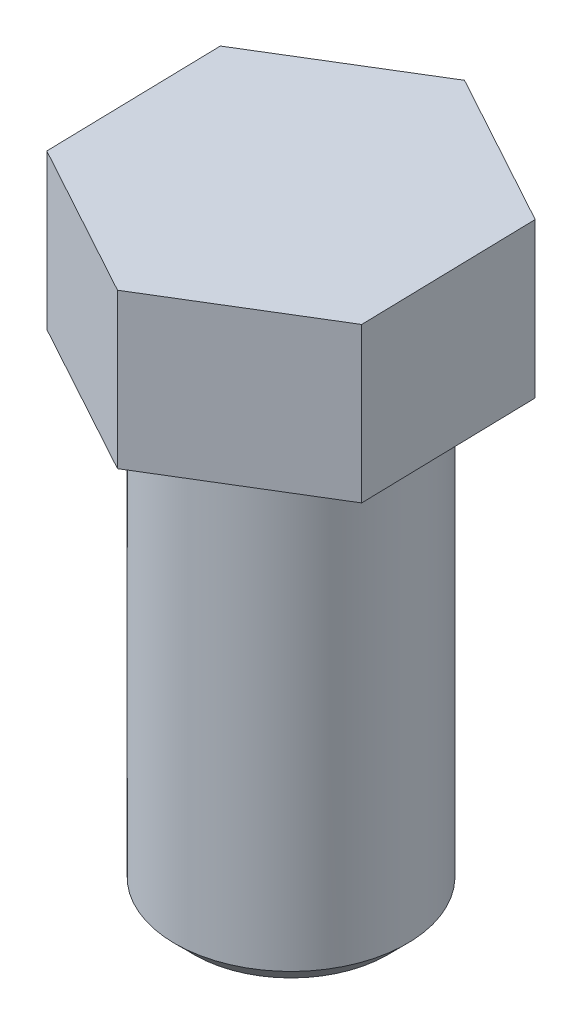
ISO-10303-21;
HEADER;
FILE_DESCRIPTION(('STEP AP214'),'2;1');
FILE_NAME('part.step','',(''),(''),'','','');
FILE_SCHEMA(('AUTOMOTIVE_DESIGN { 1 0 10303 214 1 1 1 1 }'));
ENDSEC;
DATA;
#1=APPLICATION_CONTEXT('core data for automotive mechanical design processes');
#2=APPLICATION_PROTOCOL_DEFINITION('international standard','automotive_design',2000,#1);
#3=PRODUCT_CONTEXT('',#1,'mechanical');
#4=PRODUCT('Part','Part','',(#3));
#5=PRODUCT_RELATED_PRODUCT_CATEGORY('part','',(#4));
#6=PRODUCT_DEFINITION_FORMATION('','',#4);
#7=PRODUCT_DEFINITION_CONTEXT('part definition',#1,'design');
#8=PRODUCT_DEFINITION('design','',#6,#7);
#9=PRODUCT_DEFINITION_SHAPE('','',#8);
#10=(LENGTH_UNIT() NAMED_UNIT(*) SI_UNIT(.MILLI.,.METRE.));
#11=(NAMED_UNIT(*) PLANE_ANGLE_UNIT() SI_UNIT($,.RADIAN.));
#12=(NAMED_UNIT(*) SI_UNIT($,.STERADIAN.) SOLID_ANGLE_UNIT());
#13=UNCERTAINTY_MEASURE_WITH_UNIT(LENGTH_MEASURE(1.E-05),#10,'distance_accuracy_value','');
#14=(GEOMETRIC_REPRESENTATION_CONTEXT(3) GLOBAL_UNCERTAINTY_ASSIGNED_CONTEXT((#13)) GLOBAL_UNIT_ASSIGNED_CONTEXT((#10,
#11,#12)) REPRESENTATION_CONTEXT('',''));
#15=CARTESIAN_POINT('',(0.,0.,0.));
#16=DIRECTION('',(0.,0.,1.));
#17=DIRECTION('',(1.,0.,0.));
#18=AXIS2_PLACEMENT_3D('',#15,#16,#17);
#19=CARTESIAN_POINT('',(0.,50.,0.));
#20=DIRECTION('',(0.,1.,0.));
#21=DIRECTION('',(0.,0.,1.));
#22=AXIS2_PLACEMENT_3D('',#19,#20,#21);
#23=CYLINDRICAL_SURFACE('',#22,3.);
#24=CARTESIAN_POINT('',(0.,0.500000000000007,0.));
#25=DIRECTION('',(0.,-1.,0.));
#26=DIRECTION('',(0.,0.,-1.));
#27=AXIS2_PLACEMENT_3D('',#24,#25,#26);
#28=CIRCLE('',#27,3.);
#29=CARTESIAN_POINT('',(0.,0.500000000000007,-3.));
#30=VERTEX_POINT('',#29);
#31=EDGE_CURVE('E38',#30,#30,#28,.F.);
#32=ORIENTED_EDGE('',*,*,#31,.T.);
#33=EDGE_LOOP('',(#32));
#34=FACE_BOUND('',#33,.T.);
#35=CARTESIAN_POINT('',(0.,12.,0.));
#36=DIRECTION('',(0.,1.,0.));
#37=DIRECTION('',(0.,0.,1.));
#38=AXIS2_PLACEMENT_3D('',#35,#36,#37);
#39=CIRCLE('',#38,3.);
#40=CARTESIAN_POINT('',(0.,12.,3.));
#41=VERTEX_POINT('',#40);
#42=EDGE_CURVE('E101',#41,#41,#39,.T.);
#43=ORIENTED_EDGE('',*,*,#42,.F.);
#44=EDGE_LOOP('',(#43));
#45=FACE_BOUND('',#44,.T.);
#46=ADVANCED_FACE('F31',(#34,#45),#23,.T.);
#47=CARTESIAN_POINT('',(-3.00000000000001,0.,0.));
#48=DIRECTION('',(0.,-1.,0.));
#49=DIRECTION('',(0.,0.,-1.));
#50=AXIS2_PLACEMENT_3D('',#47,#48,#49);
#51=PLANE('',#50);
#52=CARTESIAN_POINT('',(0.,0.,0.));
#53=DIRECTION('',(0.,-1.,0.));
#54=DIRECTION('',(0.,0.,-1.));
#55=AXIS2_PLACEMENT_3D('',#52,#53,#54);
#56=CIRCLE('',#55,2.5);
#57=CARTESIAN_POINT('',(0.,0.,-2.5));
#58=VERTEX_POINT('',#57);
#59=EDGE_CURVE('E11',#58,#58,#56,.T.);
#60=ORIENTED_EDGE('',*,*,#59,.T.);
#61=EDGE_LOOP('',(#60));
#62=FACE_BOUND('',#61,.T.);
#63=ADVANCED_FACE('F144',(#62),#51,.T.);
#64=CARTESIAN_POINT('',(0.,0.500000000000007,0.));
#65=DIRECTION('',(0.,1.,0.));
#66=DIRECTION('',(0.,0.,1.));
#67=AXIS2_PLACEMENT_3D('',#64,#65,#66);
#68=CONICAL_SURFACE('',#67,3.,0.785398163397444);
#69=ORIENTED_EDGE('',*,*,#59,.F.);
#70=EDGE_LOOP('',(#69));
#71=FACE_BOUND('',#70,.T.);
#72=ORIENTED_EDGE('',*,*,#31,.F.);
#73=EDGE_LOOP('',(#72));
#74=FACE_BOUND('',#73,.T.);
#75=ADVANCED_FACE('F142',(#71,#74),#68,.T.);
#76=CARTESIAN_POINT('',(4.03522053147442,16.,2.20566412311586));
#77=DIRECTION('',(-0.999726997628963,0.,0.0233651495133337));
#78=DIRECTION('',(0.0233651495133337,0.,0.999726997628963));
#79=AXIS2_PLACEMENT_3D('',#76,#77,#78);
#80=PLANE('',#79);
#81=DIRECTION('',(-0.0233651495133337,0.,-0.999726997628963));
#82=VECTOR('',#81,1.);
#83=CARTESIAN_POINT('',(4.03522053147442,12.,2.20566412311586));
#84=LINE('',#83,#82);
#85=CARTESIAN_POINT('',(4.03522053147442,12.,2.20566412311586));
#86=VERTEX_POINT('',#85);
#87=CARTESIAN_POINT('',(3.92777142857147,12.,-2.39177142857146));
#88=VERTEX_POINT('',#87);
#89=EDGE_CURVE('E88',#86,#88,#84,.T.);
#90=ORIENTED_EDGE('',*,*,#89,.T.);
#91=DIRECTION('',(0.,-1.,0.));
#92=VECTOR('',#91,1.);
#93=CARTESIAN_POINT('',(3.92777142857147,16.,-2.39177142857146));
#94=LINE('',#93,#92);
#95=CARTESIAN_POINT('',(3.92777142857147,16.,-2.39177142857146));
#96=VERTEX_POINT('',#95);
#97=EDGE_CURVE('E96',#96,#88,#94,.T.);
#98=ORIENTED_EDGE('',*,*,#97,.F.);
#99=DIRECTION('',(-0.0233651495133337,0.,-0.999726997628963));
#100=VECTOR('',#99,1.);
#101=CARTESIAN_POINT('',(4.03522053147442,16.,2.20566412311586));
#102=LINE('',#101,#100);
#103=CARTESIAN_POINT('',(4.03522053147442,16.,2.20566412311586));
#104=VERTEX_POINT('',#103);
#105=EDGE_CURVE('E116',#104,#96,#102,.T.);
#106=ORIENTED_EDGE('',*,*,#105,.F.);
#107=DIRECTION('',(0.,-1.,0.));
#108=VECTOR('',#107,1.);
#109=CARTESIAN_POINT('',(4.03522053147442,16.,2.20566412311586));
#110=LINE('',#109,#108);
#111=EDGE_CURVE('E106',#104,#86,#110,.T.);
#112=ORIENTED_EDGE('',*,*,#111,.T.);
#113=EDGE_LOOP('',(#90,#98,#106,#112));
#114=FACE_BOUND('',#113,.T.);
#115=ADVANCED_FACE('F105',(#114),#80,.F.);
#116=CARTESIAN_POINT('',(3.92777142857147,16.,-2.39177142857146));
#117=DIRECTION('',(-0.479628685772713,0.,0.877471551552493));
#118=DIRECTION('',(0.877471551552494,0.,0.479628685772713));
#119=AXIS2_PLACEMENT_3D('',#116,#117,#118);
#120=PLANE('',#119);
#121=DIRECTION('',(-0.877471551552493,0.,-0.479628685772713));
#122=VECTOR('',#121,1.);
#123=CARTESIAN_POINT('',(3.92777142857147,12.,-2.39177142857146));
#124=LINE('',#123,#122);
#125=CARTESIAN_POINT('',(-0.107449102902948,12.,-4.59743555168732));
#126=VERTEX_POINT('',#125);
#127=EDGE_CURVE('E83',#88,#126,#124,.T.);
#128=ORIENTED_EDGE('',*,*,#127,.T.);
#129=DIRECTION('',(0.,-1.,0.));
#130=VECTOR('',#129,1.);
#131=CARTESIAN_POINT('',(-0.107449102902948,16.,-4.59743555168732));
#132=LINE('',#131,#130);
#133=CARTESIAN_POINT('',(-0.107449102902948,16.,-4.59743555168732));
#134=VERTEX_POINT('',#133);
#135=EDGE_CURVE('E102',#134,#126,#132,.T.);
#136=ORIENTED_EDGE('',*,*,#135,.F.);
#137=DIRECTION('',(-0.877471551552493,0.,-0.479628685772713));
#138=VECTOR('',#137,1.);
#139=CARTESIAN_POINT('',(3.92777142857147,16.,-2.39177142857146));
#140=LINE('',#139,#138);
#141=EDGE_CURVE('E98',#96,#134,#140,.T.);
#142=ORIENTED_EDGE('',*,*,#141,.F.);
#143=ORIENTED_EDGE('',*,*,#97,.T.);
#144=EDGE_LOOP('',(#128,#136,#142,#143));
#145=FACE_BOUND('',#144,.T.);
#146=ADVANCED_FACE('F97',(#145),#120,.F.);
#147=CARTESIAN_POINT('',(-0.107449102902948,16.,-4.59743555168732));
#148=DIRECTION('',(0.52009831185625,0.,0.85410640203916));
#149=DIRECTION('',(0.85410640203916,0.,-0.52009831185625));
#150=AXIS2_PLACEMENT_3D('',#147,#148,#149);
#151=PLANE('',#150);
#152=DIRECTION('',(-0.85410640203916,0.,0.52009831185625));
#153=VECTOR('',#152,1.);
#154=CARTESIAN_POINT('',(-0.107449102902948,12.,-4.59743555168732));
#155=LINE('',#154,#153);
#156=CARTESIAN_POINT('',(-4.03522053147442,12.,-2.20566412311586));
#157=VERTEX_POINT('',#156);
#158=EDGE_CURVE('E90',#126,#157,#155,.T.);
#159=ORIENTED_EDGE('',*,*,#158,.T.);
#160=DIRECTION('',(0.,-1.,0.));
#161=VECTOR('',#160,1.);
#162=CARTESIAN_POINT('',(-4.03522053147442,16.,-2.20566412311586));
#163=LINE('',#162,#161);
#164=CARTESIAN_POINT('',(-4.03522053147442,16.,-2.20566412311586));
#165=VERTEX_POINT('',#164);
#166=EDGE_CURVE('E132',#165,#157,#163,.T.);
#167=ORIENTED_EDGE('',*,*,#166,.F.);
#168=DIRECTION('',(-0.85410640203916,0.,0.52009831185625));
#169=VECTOR('',#168,1.);
#170=CARTESIAN_POINT('',(-0.107449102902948,16.,-4.59743555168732));
#171=LINE('',#170,#169);
#172=EDGE_CURVE('E119',#134,#165,#171,.T.);
#173=ORIENTED_EDGE('',*,*,#172,.F.);
#174=ORIENTED_EDGE('',*,*,#135,.T.);
#175=EDGE_LOOP('',(#159,#167,#173,#174));
#176=FACE_BOUND('',#175,.T.);
#177=ADVANCED_FACE('F174',(#176),#151,.F.);
#178=CARTESIAN_POINT('',(-4.03522053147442,16.,-2.20566412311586));
#179=DIRECTION('',(0.999726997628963,0.,-0.0233651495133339));
#180=DIRECTION('',(-0.0233651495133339,0.,-0.999726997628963));
#181=AXIS2_PLACEMENT_3D('',#178,#179,#180);
#182=PLANE('',#181);
#183=DIRECTION('',(0.0233651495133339,0.,0.999726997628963));
#184=VECTOR('',#183,1.);
#185=CARTESIAN_POINT('',(-4.03522053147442,12.,-2.20566412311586));
#186=LINE('',#185,#184);
#187=CARTESIAN_POINT('',(-3.92777142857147,12.,2.39177142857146));
#188=VERTEX_POINT('',#187);
#189=EDGE_CURVE('E110',#157,#188,#186,.T.);
#190=ORIENTED_EDGE('',*,*,#189,.T.);
#191=DIRECTION('',(0.,-1.,0.));
#192=VECTOR('',#191,1.);
#193=CARTESIAN_POINT('',(-3.92777142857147,16.,2.39177142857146));
#194=LINE('',#193,#192);
#195=CARTESIAN_POINT('',(-3.92777142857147,16.,2.39177142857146));
#196=VERTEX_POINT('',#195);
#197=EDGE_CURVE('E129',#196,#188,#194,.T.);
#198=ORIENTED_EDGE('',*,*,#197,.F.);
#199=DIRECTION('',(0.0233651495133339,0.,0.999726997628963));
#200=VECTOR('',#199,1.);
#201=CARTESIAN_POINT('',(-4.03522053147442,16.,-2.20566412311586));
#202=LINE('',#201,#200);
#203=EDGE_CURVE('E121',#165,#196,#202,.T.);
#204=ORIENTED_EDGE('',*,*,#203,.F.);
#205=ORIENTED_EDGE('',*,*,#166,.T.);
#206=EDGE_LOOP('',(#190,#198,#204,#205));
#207=FACE_BOUND('',#206,.T.);
#208=ADVANCED_FACE('F181',(#207),#182,.F.);
#209=CARTESIAN_POINT('',(-3.92777142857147,16.,2.39177142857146));
#210=DIRECTION('',(0.479628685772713,0.,-0.877471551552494));
#211=DIRECTION('',(-0.877471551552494,0.,-0.479628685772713));
#212=AXIS2_PLACEMENT_3D('',#209,#210,#211);
#213=PLANE('',#212);
#214=DIRECTION('',(0.877471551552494,0.,0.479628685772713));
#215=VECTOR('',#214,1.);
#216=CARTESIAN_POINT('',(-3.92777142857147,12.,2.39177142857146));
#217=LINE('',#216,#215);
#218=CARTESIAN_POINT('',(0.107449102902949,12.,4.59743555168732));
#219=VERTEX_POINT('',#218);
#220=EDGE_CURVE('E112',#188,#219,#217,.T.);
#221=ORIENTED_EDGE('',*,*,#220,.T.);
#222=DIRECTION('',(0.,-1.,0.));
#223=VECTOR('',#222,1.);
#224=CARTESIAN_POINT('',(0.107449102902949,16.,4.59743555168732));
#225=LINE('',#224,#223);
#226=CARTESIAN_POINT('',(0.107449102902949,16.,4.59743555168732));
#227=VERTEX_POINT('',#226);
#228=EDGE_CURVE('E126',#227,#219,#225,.T.);
#229=ORIENTED_EDGE('',*,*,#228,.F.);
#230=DIRECTION('',(0.877471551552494,0.,0.479628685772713));
#231=VECTOR('',#230,1.);
#232=CARTESIAN_POINT('',(-3.92777142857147,16.,2.39177142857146));
#233=LINE('',#232,#231);
#234=EDGE_CURVE('E50',#196,#227,#233,.T.);
#235=ORIENTED_EDGE('',*,*,#234,.F.);
#236=ORIENTED_EDGE('',*,*,#197,.T.);
#237=EDGE_LOOP('',(#221,#229,#235,#236));
#238=FACE_BOUND('',#237,.T.);
#239=ADVANCED_FACE('F189',(#238),#213,.F.);
#240=CARTESIAN_POINT('',(0.107449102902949,16.,4.59743555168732));
#241=DIRECTION('',(-0.52009831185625,0.,-0.85410640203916));
#242=DIRECTION('',(-0.85410640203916,0.,0.52009831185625));
#243=AXIS2_PLACEMENT_3D('',#240,#241,#242);
#244=PLANE('',#243);
#245=DIRECTION('',(0.85410640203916,0.,-0.52009831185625));
#246=VECTOR('',#245,1.);
#247=CARTESIAN_POINT('',(0.107449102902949,12.,4.59743555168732));
#248=LINE('',#247,#246);
#249=EDGE_CURVE('E114',#219,#86,#248,.T.);
#250=ORIENTED_EDGE('',*,*,#249,.T.);
#251=ORIENTED_EDGE('',*,*,#111,.F.);
#252=DIRECTION('',(0.85410640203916,0.,-0.52009831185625));
#253=VECTOR('',#252,1.);
#254=CARTESIAN_POINT('',(0.107449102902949,16.,4.59743555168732));
#255=LINE('',#254,#253);
#256=EDGE_CURVE('E45',#227,#104,#255,.T.);
#257=ORIENTED_EDGE('',*,*,#256,.F.);
#258=ORIENTED_EDGE('',*,*,#228,.T.);
#259=EDGE_LOOP('',(#250,#251,#257,#258));
#260=FACE_BOUND('',#259,.T.);
#261=ADVANCED_FACE('F197',(#260),#244,.F.);
#262=CARTESIAN_POINT('',(4.14266963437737,16.,6.80309967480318));
#263=DIRECTION('',(0.,-1.,0.));
#264=DIRECTION('',(0.,0.,-1.));
#265=AXIS2_PLACEMENT_3D('',#262,#263,#264);
#266=PLANE('',#265);
#267=ORIENTED_EDGE('',*,*,#105,.T.);
#268=ORIENTED_EDGE('',*,*,#141,.T.);
#269=ORIENTED_EDGE('',*,*,#172,.T.);
#270=ORIENTED_EDGE('',*,*,#203,.T.);
#271=ORIENTED_EDGE('',*,*,#234,.T.);
#272=ORIENTED_EDGE('',*,*,#256,.T.);
#273=EDGE_LOOP('',(#267,#268,#269,#270,#271,#272));
#274=FACE_BOUND('',#273,.T.);
#275=ADVANCED_FACE('F205',(#274),#266,.F.);
#276=CARTESIAN_POINT('',(4.14266963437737,12.,6.80309967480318));
#277=DIRECTION('',(0.,-1.,0.));
#278=DIRECTION('',(0.,0.,-1.));
#279=AXIS2_PLACEMENT_3D('',#276,#277,#278);
#280=PLANE('',#279);
#281=ORIENTED_EDGE('',*,*,#42,.T.);
#282=EDGE_LOOP('',(#281));
#283=FACE_BOUND('',#282,.T.);
#284=ORIENTED_EDGE('',*,*,#89,.F.);
#285=ORIENTED_EDGE('',*,*,#249,.F.);
#286=ORIENTED_EDGE('',*,*,#220,.F.);
#287=ORIENTED_EDGE('',*,*,#189,.F.);
#288=ORIENTED_EDGE('',*,*,#158,.F.);
#289=ORIENTED_EDGE('',*,*,#127,.F.);
#290=EDGE_LOOP('',(#284,#285,#286,#287,#288,#289));
#291=FACE_BOUND('',#290,.T.);
#292=ADVANCED_FACE('F85',(#283,#291),#280,.T.);
#293=CLOSED_SHELL('',(#46,#63,#75,#115,#146,#177,#208,#239,#261,#275,#292));
#294=MANIFOLD_SOLID_BREP('B2',#293);
#295=ADVANCED_BREP_SHAPE_REPRESENTATION('',(#18,#294),#14);
#296=SHAPE_DEFINITION_REPRESENTATION(#9,#295);
ENDSEC;
END-ISO-10303-21;
